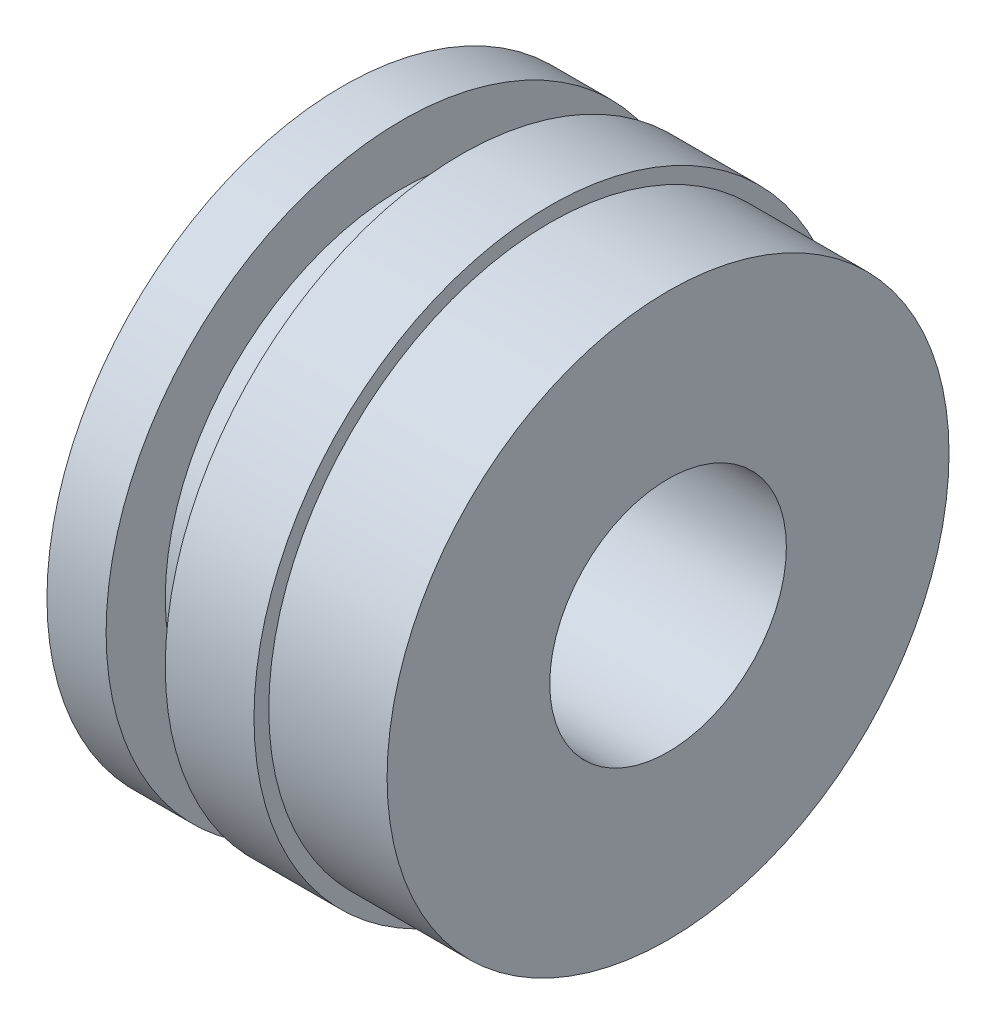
from build123d import *


with BuildPart() as part:
    # Esquisse1 → Base-R_volution (revolve)
    with BuildSketch(Plane.XY, mode=Mode.PRIVATE) as base_r_volution_sk:
        Polygon((0, 4), (11, 4), (11, 9.5), (7, 9.5), (7, 10), (4, 10), (4, 8), (2, 8), (2, 10), (0, 10), align=None)
    revolve(base_r_volution_sk.sketch.rotate(Axis((-25, 0, 0), (1, 0, 0)), 90), axis=Axis((-25, 0, 0), (1, 0, 0)))


solid = part.part
